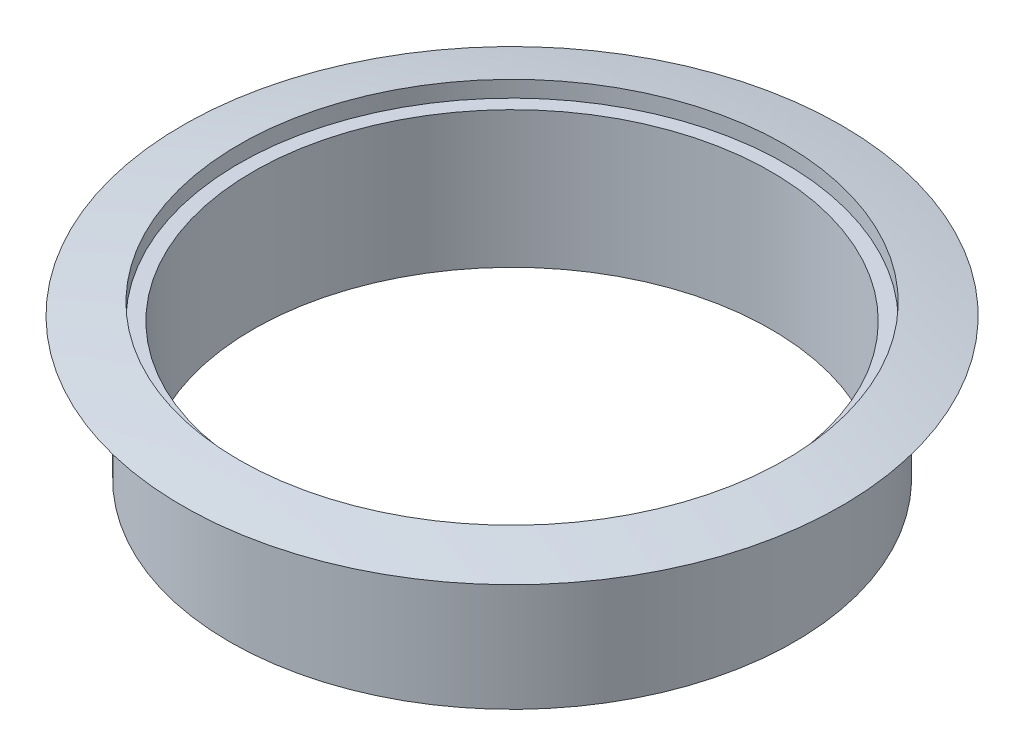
from build123d import *

# Parameters (mm, degrees)
SKETCH1_R           = 30
SKETCH1_R_2         = 27.5
BOSS_EXTRUDE1_DEPTH = 15
SKETCH3_R           = 29
CUT_EXTRUDE1_DEPTH  = 2


with BuildPart() as part:
    # Sketch1 → Boss-Extrude1 (new body)
    with BuildSketch(Plane(origin=(0, 0, 0), x_dir=(1, 0, 0), z_dir=(0, 1, 0))):
        with Locations(Location((0, 0, 0), (0, 0, 270))):
            Circle(SKETCH1_R)
        with Locations(Location((0, 0, 0), (0, 0, 270))):
            Circle(SKETCH1_R_2, mode=Mode.SUBTRACT)
    extrude(amount=-BOSS_EXTRUDE1_DEPTH)

    # Sketch2 → Revolve1 (revolve)
    with BuildSketch(Plane(origin=(0, 0, 0), x_dir=(0, 0, -1), z_dir=(1, 0, 0))):
        with BuildLine():
            Line((-27.5, 0), (-35, 0))
            ThreePointArc((-35, 0), (-31.258686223, 0.793431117), (-27.5, 1.5))
            Line((-27.5, 1.5), (-27.5, 0))
        make_face()
    revolve(axis=Axis((0, 0, 0), (0, 1, 0)))

    # Sketch3 → Cut-Extrude1 (cut)
    with BuildSketch(Plane(origin=(0, 1.5, 0), x_dir=(-1, 0, 0), z_dir=(0, 1, 0))):
        with Locations(Location((0, 0, 0), (0, 0, 90))):
            Circle(SKETCH3_R)
    extrude(amount=-CUT_EXTRUDE1_DEPTH, mode=Mode.SUBTRACT)


solid = part.part
